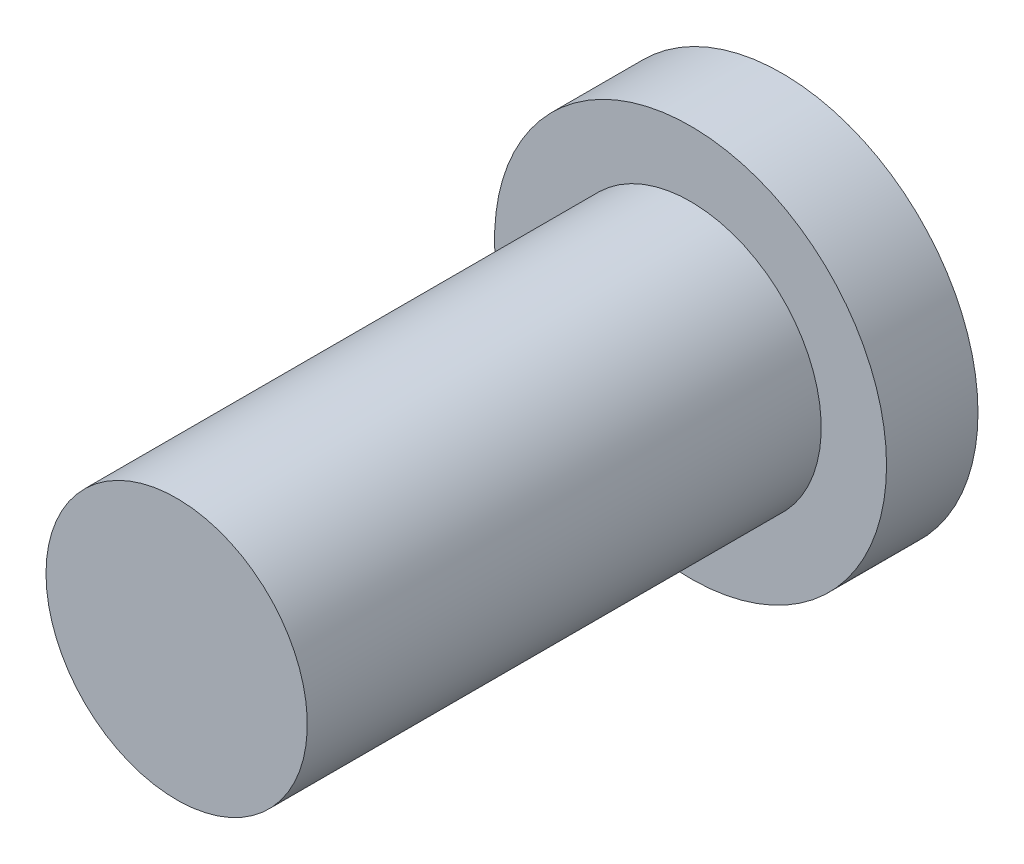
ISO-10303-21;
HEADER;
FILE_DESCRIPTION(('STEP AP214'),'2;1');
FILE_NAME('part.step','',(''),(''),'','','');
FILE_SCHEMA(('AUTOMOTIVE_DESIGN { 1 0 10303 214 1 1 1 1 }'));
ENDSEC;
DATA;
#1=APPLICATION_CONTEXT('core data for automotive mechanical design processes');
#2=APPLICATION_PROTOCOL_DEFINITION('international standard','automotive_design',2000,#1);
#3=PRODUCT_CONTEXT('',#1,'mechanical');
#4=PRODUCT('Part','Part','',(#3));
#5=PRODUCT_RELATED_PRODUCT_CATEGORY('part','',(#4));
#6=PRODUCT_DEFINITION_FORMATION('','',#4);
#7=PRODUCT_DEFINITION_CONTEXT('part definition',#1,'design');
#8=PRODUCT_DEFINITION('design','',#6,#7);
#9=PRODUCT_DEFINITION_SHAPE('','',#8);
#10=(LENGTH_UNIT() NAMED_UNIT(*) SI_UNIT(.MILLI.,.METRE.));
#11=(NAMED_UNIT(*) PLANE_ANGLE_UNIT() SI_UNIT($,.RADIAN.));
#12=(NAMED_UNIT(*) SI_UNIT($,.STERADIAN.) SOLID_ANGLE_UNIT());
#13=UNCERTAINTY_MEASURE_WITH_UNIT(LENGTH_MEASURE(1.E-05),#10,'distance_accuracy_value','');
#14=(GEOMETRIC_REPRESENTATION_CONTEXT(3) GLOBAL_UNCERTAINTY_ASSIGNED_CONTEXT((#13)) GLOBAL_UNIT_ASSIGNED_CONTEXT((#10,
#11,#12)) REPRESENTATION_CONTEXT('',''));
#15=CARTESIAN_POINT('',(0.,0.,0.));
#16=DIRECTION('',(0.,0.,1.));
#17=DIRECTION('',(1.,0.,0.));
#18=AXIS2_PLACEMENT_3D('',#15,#16,#17);
#19=CARTESIAN_POINT('',(0.,0.,0.5334));
#20=DIRECTION('',(0.,0.,1.));
#21=DIRECTION('',(1.,0.,0.));
#22=AXIS2_PLACEMENT_3D('',#19,#20,#21);
#23=PLANE('',#22);
#24=CARTESIAN_POINT('',(0.,0.,0.5334));
#25=DIRECTION('',(0.,0.,1.));
#26=DIRECTION('',(1.,0.,0.));
#27=AXIS2_PLACEMENT_3D('',#24,#25,#26);
#28=CIRCLE('',#27,1.143);
#29=CARTESIAN_POINT('',(1.143,0.,0.5334));
#30=VERTEX_POINT('',#29);
#31=EDGE_CURVE('E11',#30,#30,#28,.T.);
#32=ORIENTED_EDGE('',*,*,#31,.T.);
#33=EDGE_LOOP('',(#32));
#34=FACE_BOUND('',#33,.T.);
#35=CARTESIAN_POINT('',(0.,0.,0.5334));
#36=DIRECTION('',(0.,0.,1.));
#37=DIRECTION('',(1.,0.,0.));
#38=AXIS2_PLACEMENT_3D('',#35,#36,#37);
#39=CIRCLE('',#38,0.762);
#40=CARTESIAN_POINT('',(-0.762,0.,0.5334));
#41=VERTEX_POINT('',#40);
#42=EDGE_CURVE('E189',#41,#41,#39,.T.);
#43=ORIENTED_EDGE('',*,*,#42,.F.);
#44=EDGE_LOOP('',(#43));
#45=FACE_BOUND('',#44,.T.);
#46=ADVANCED_FACE('F33',(#34,#45),#23,.T.);
#47=CARTESIAN_POINT('',(0.,0.,0.5334));
#48=DIRECTION('',(0.,0.,-1.));
#49=DIRECTION('',(-1.,0.,0.));
#50=AXIS2_PLACEMENT_3D('',#47,#48,#49);
#51=CYLINDRICAL_SURFACE('',#50,1.143);
#52=ORIENTED_EDGE('',*,*,#31,.F.);
#53=EDGE_LOOP('',(#52));
#54=FACE_BOUND('',#53,.T.);
#55=CARTESIAN_POINT('',(0.,0.,0.));
#56=DIRECTION('',(0.,0.,1.));
#57=DIRECTION('',(1.,0.,0.));
#58=AXIS2_PLACEMENT_3D('',#55,#56,#57);
#59=CIRCLE('',#58,1.143);
#60=CARTESIAN_POINT('',(1.143,0.,0.));
#61=VERTEX_POINT('',#60);
#62=EDGE_CURVE('E37',#61,#61,#59,.T.);
#63=ORIENTED_EDGE('',*,*,#62,.T.);
#64=EDGE_LOOP('',(#63));
#65=FACE_BOUND('',#64,.T.);
#66=ADVANCED_FACE('F35',(#54,#65),#51,.T.);
#67=CARTESIAN_POINT('',(0.,0.,0.));
#68=DIRECTION('',(0.,0.,1.));
#69=DIRECTION('',(1.,0.,0.));
#70=AXIS2_PLACEMENT_3D('',#67,#68,#69);
#71=PLANE('',#70);
#72=DIRECTION('',(-1.,0.,0.));
#73=VECTOR('',#72,1.);
#74=CARTESIAN_POINT('',(0.5715,-0.1905,0.));
#75=LINE('',#74,#73);
#76=CARTESIAN_POINT('',(0.5715,-0.1905,0.));
#77=VERTEX_POINT('',#76);
#78=CARTESIAN_POINT('',(0.1905,-0.1905,0.));
#79=VERTEX_POINT('',#78);
#80=EDGE_CURVE('E158',#77,#79,#75,.T.);
#81=ORIENTED_EDGE('',*,*,#80,.F.);
#82=DIRECTION('',(0.,-1.,0.));
#83=VECTOR('',#82,1.);
#84=CARTESIAN_POINT('',(0.5715,0.1905,0.));
#85=LINE('',#84,#83);
#86=CARTESIAN_POINT('',(0.5715,0.1905,0.));
#87=VERTEX_POINT('',#86);
#88=EDGE_CURVE('E48',#87,#77,#85,.T.);
#89=ORIENTED_EDGE('',*,*,#88,.F.);
#90=DIRECTION('',(1.,0.,0.));
#91=VECTOR('',#90,1.);
#92=CARTESIAN_POINT('',(0.5715,0.1905,0.));
#93=LINE('',#92,#91);
#94=CARTESIAN_POINT('',(0.1905,0.1905,0.));
#95=VERTEX_POINT('',#94);
#96=EDGE_CURVE('E185',#95,#87,#93,.T.);
#97=ORIENTED_EDGE('',*,*,#96,.F.);
#98=DIRECTION('',(0.,-1.,0.));
#99=VECTOR('',#98,1.);
#100=CARTESIAN_POINT('',(0.1905,0.5715,0.));
#101=LINE('',#100,#99);
#102=CARTESIAN_POINT('',(0.1905,0.5715,0.));
#103=VERTEX_POINT('',#102);
#104=EDGE_CURVE('E183',#103,#95,#101,.T.);
#105=ORIENTED_EDGE('',*,*,#104,.F.);
#106=DIRECTION('',(1.,0.,0.));
#107=VECTOR('',#106,1.);
#108=CARTESIAN_POINT('',(0.1905,0.5715,0.));
#109=LINE('',#108,#107);
#110=CARTESIAN_POINT('',(-0.1905,0.5715,0.));
#111=VERTEX_POINT('',#110);
#112=EDGE_CURVE('E132',#111,#103,#109,.T.);
#113=ORIENTED_EDGE('',*,*,#112,.F.);
#114=DIRECTION('',(0.,1.,0.));
#115=VECTOR('',#114,1.);
#116=CARTESIAN_POINT('',(-0.1905,0.5715,0.));
#117=LINE('',#116,#115);
#118=CARTESIAN_POINT('',(-0.1905,0.1905,0.));
#119=VERTEX_POINT('',#118);
#120=EDGE_CURVE('E179',#119,#111,#117,.T.);
#121=ORIENTED_EDGE('',*,*,#120,.F.);
#122=DIRECTION('',(1.,0.,0.));
#123=VECTOR('',#122,1.);
#124=CARTESIAN_POINT('',(-0.1905,0.1905,0.));
#125=LINE('',#124,#123);
#126=CARTESIAN_POINT('',(-0.5715,0.1905,0.));
#127=VERTEX_POINT('',#126);
#128=EDGE_CURVE('E176',#127,#119,#125,.T.);
#129=ORIENTED_EDGE('',*,*,#128,.F.);
#130=DIRECTION('',(0.,1.,0.));
#131=VECTOR('',#130,1.);
#132=CARTESIAN_POINT('',(-0.5715,0.1905,0.));
#133=LINE('',#132,#131);
#134=CARTESIAN_POINT('',(-0.5715,-0.1905,0.));
#135=VERTEX_POINT('',#134);
#136=EDGE_CURVE('E173',#135,#127,#133,.T.);
#137=ORIENTED_EDGE('',*,*,#136,.F.);
#138=DIRECTION('',(-1.,0.,0.));
#139=VECTOR('',#138,1.);
#140=CARTESIAN_POINT('',(-0.1905,-0.1905,0.));
#141=LINE('',#140,#139);
#142=CARTESIAN_POINT('',(-0.1905,-0.1905,0.));
#143=VERTEX_POINT('',#142);
#144=EDGE_CURVE('E170',#143,#135,#141,.T.);
#145=ORIENTED_EDGE('',*,*,#144,.F.);
#146=DIRECTION('',(0.,1.,0.));
#147=VECTOR('',#146,1.);
#148=CARTESIAN_POINT('',(-0.1905,-0.1905,0.));
#149=LINE('',#148,#147);
#150=CARTESIAN_POINT('',(-0.1905,-0.5715,0.));
#151=VERTEX_POINT('',#150);
#152=EDGE_CURVE('E167',#151,#143,#149,.T.);
#153=ORIENTED_EDGE('',*,*,#152,.F.);
#154=DIRECTION('',(-1.,0.,0.));
#155=VECTOR('',#154,1.);
#156=CARTESIAN_POINT('',(0.1905,-0.5715,0.));
#157=LINE('',#156,#155);
#158=CARTESIAN_POINT('',(0.1905,-0.5715,0.));
#159=VERTEX_POINT('',#158);
#160=EDGE_CURVE('E164',#159,#151,#157,.T.);
#161=ORIENTED_EDGE('',*,*,#160,.F.);
#162=DIRECTION('',(0.,-1.,0.));
#163=VECTOR('',#162,1.);
#164=CARTESIAN_POINT('',(0.1905,-0.1905,0.));
#165=LINE('',#164,#163);
#166=EDGE_CURVE('E161',#79,#159,#165,.T.);
#167=ORIENTED_EDGE('',*,*,#166,.F.);
#168=EDGE_LOOP('',(#81,#89,#97,#105,#113,#121,#129,#137,#145,#153,#161,#167));
#169=FACE_BOUND('',#168,.T.);
#170=ORIENTED_EDGE('',*,*,#62,.F.);
#171=EDGE_LOOP('',(#170));
#172=FACE_BOUND('',#171,.T.);
#173=ADVANCED_FACE('F221',(#169,#172),#71,.F.);
#174=CARTESIAN_POINT('',(0.,0.,3.5306));
#175=DIRECTION('',(0.,0.,-1.));
#176=DIRECTION('',(-1.,0.,0.));
#177=AXIS2_PLACEMENT_3D('',#174,#175,#176);
#178=CYLINDRICAL_SURFACE('',#177,0.762);
#179=CARTESIAN_POINT('',(0.,0.,3.5306));
#180=DIRECTION('',(0.,0.,1.));
#181=DIRECTION('',(1.,0.,0.));
#182=AXIS2_PLACEMENT_3D('',#179,#180,#181);
#183=CIRCLE('',#182,0.762);
#184=CARTESIAN_POINT('',(-0.762,0.,3.5306));
#185=VERTEX_POINT('',#184);
#186=EDGE_CURVE('E207',#185,#185,#183,.T.);
#187=CARTESIAN_POINT('',(-0.762,0.,3.5306));
#188=CARTESIAN_POINT('',(-0.762,0.,3.49937916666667));
#189=CARTESIAN_POINT('',(-0.762,0.,3.46815833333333));
#190=CARTESIAN_POINT('',(-0.762,0.,3.40571666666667));
#191=CARTESIAN_POINT('',(-0.762,0.,3.37449583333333));
#192=CARTESIAN_POINT('',(-0.762,0.,3.31205416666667));
#193=CARTESIAN_POINT('',(-0.762,0.,3.28083333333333));
#194=CARTESIAN_POINT('',(-0.762,0.,3.21839166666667));
#195=CARTESIAN_POINT('',(-0.762,0.,3.18717083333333));
#196=CARTESIAN_POINT('',(-0.762,0.,3.12472916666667));
#197=CARTESIAN_POINT('',(-0.762,0.,3.09350833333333));
#198=CARTESIAN_POINT('',(-0.762,0.,3.03106666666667));
#199=CARTESIAN_POINT('',(-0.762,0.,2.99984583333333));
#200=CARTESIAN_POINT('',(-0.762,0.,2.93740416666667));
#201=CARTESIAN_POINT('',(-0.762,0.,2.90618333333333));
#202=CARTESIAN_POINT('',(-0.762,0.,2.84374166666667));
#203=CARTESIAN_POINT('',(-0.762,0.,2.81252083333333));
#204=CARTESIAN_POINT('',(-0.762,0.,2.75007916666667));
#205=CARTESIAN_POINT('',(-0.762,0.,2.71885833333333));
#206=CARTESIAN_POINT('',(-0.762,0.,2.65641666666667));
#207=CARTESIAN_POINT('',(-0.762,0.,2.62519583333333));
#208=CARTESIAN_POINT('',(-0.762,0.,2.56275416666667));
#209=CARTESIAN_POINT('',(-0.762,0.,2.53153333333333));
#210=CARTESIAN_POINT('',(-0.762,0.,2.46909166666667));
#211=CARTESIAN_POINT('',(-0.762,0.,2.43787083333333));
#212=CARTESIAN_POINT('',(-0.762,0.,2.37542916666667));
#213=CARTESIAN_POINT('',(-0.762,0.,2.34420833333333));
#214=CARTESIAN_POINT('',(-0.762,0.,2.28176666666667));
#215=CARTESIAN_POINT('',(-0.762,0.,2.25054583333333));
#216=CARTESIAN_POINT('',(-0.762,0.,2.18810416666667));
#217=CARTESIAN_POINT('',(-0.762,0.,2.15688333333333));
#218=CARTESIAN_POINT('',(-0.762,0.,2.09444166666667));
#219=CARTESIAN_POINT('',(-0.762,0.,2.06322083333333));
#220=CARTESIAN_POINT('',(-0.762,0.,2.00077916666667));
#221=CARTESIAN_POINT('',(-0.762,0.,1.96955833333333));
#222=CARTESIAN_POINT('',(-0.762,0.,1.90711666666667));
#223=CARTESIAN_POINT('',(-0.762,0.,1.87589583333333));
#224=CARTESIAN_POINT('',(-0.762,0.,1.81345416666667));
#225=CARTESIAN_POINT('',(-0.762,0.,1.78223333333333));
#226=CARTESIAN_POINT('',(-0.762,0.,1.71979166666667));
#227=CARTESIAN_POINT('',(-0.762,0.,1.68857083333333));
#228=CARTESIAN_POINT('',(-0.762,0.,1.62612916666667));
#229=CARTESIAN_POINT('',(-0.762,0.,1.59490833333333));
#230=CARTESIAN_POINT('',(-0.762,0.,1.53246666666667));
#231=CARTESIAN_POINT('',(-0.762,0.,1.50124583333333));
#232=CARTESIAN_POINT('',(-0.762,0.,1.43880416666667));
#233=CARTESIAN_POINT('',(-0.762,0.,1.40758333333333));
#234=CARTESIAN_POINT('',(-0.762,0.,1.34514166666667));
#235=CARTESIAN_POINT('',(-0.762,0.,1.31392083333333));
#236=CARTESIAN_POINT('',(-0.762,0.,1.25147916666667));
#237=CARTESIAN_POINT('',(-0.762,0.,1.22025833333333));
#238=CARTESIAN_POINT('',(-0.762,0.,1.15781666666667));
#239=CARTESIAN_POINT('',(-0.762,0.,1.12659583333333));
#240=CARTESIAN_POINT('',(-0.762,0.,1.06415416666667));
#241=CARTESIAN_POINT('',(-0.762,0.,1.03293333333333));
#242=CARTESIAN_POINT('',(-0.762,0.,0.970491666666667));
#243=CARTESIAN_POINT('',(-0.762,0.,0.939270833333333));
#244=CARTESIAN_POINT('',(-0.762,0.,0.876829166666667));
#245=CARTESIAN_POINT('',(-0.762,0.,0.845608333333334));
#246=CARTESIAN_POINT('',(-0.762,0.,0.783166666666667));
#247=CARTESIAN_POINT('',(-0.762,0.,0.751945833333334));
#248=CARTESIAN_POINT('',(-0.762,0.,0.689504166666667));
#249=CARTESIAN_POINT('',(-0.762,0.,0.658283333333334));
#250=CARTESIAN_POINT('',(-0.762,0.,0.595841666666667));
#251=CARTESIAN_POINT('',(-0.762,0.,0.564620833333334));
#252=CARTESIAN_POINT('',(-0.762,0.,0.5334));
#253=B_SPLINE_CURVE_WITH_KNOTS('',3,(#187,#188,#189,#190,#191,#192,#193,#194,#195,#196,#197,
#198,#199,#200,#201,#202,#203,#204,#205,#206,#207,#208,#209,#210,#211,#212,#213,#214,#215,#216,
#217,#218,#219,#220,#221,#222,#223,#224,#225,#226,#227,#228,#229,#230,#231,#232,#233,#234,#235,
#236,#237,#238,#239,#240,#241,#242,#243,#244,#245,#246,#247,#248,#249,#250,#251,#252),
.UNSPECIFIED.,.F.,.F.,(4,2,2,2,2,2,2,2,2,2,2,2,2,2,2,2,2,2,2,2,2,2,2,2,2,2,2,2,2,2,2,2,4),(0.,
0.0936624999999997,0.187325,0.2809875,0.37465,0.4683125,0.561975,0.6556375,0.7493,
0.842962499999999,0.936624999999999,1.0302875,1.12395,1.2176125,1.311275,1.4049375,1.4986,
1.5922625,1.685925,1.7795875,1.87325,1.9669125,2.060575,2.1542375,2.2479,2.3415625,2.435225,
2.5288875,2.62255,2.7162125,2.809875,2.9035375,2.9972),.UNSPECIFIED.);
#254=EDGE_CURVE('BSEAM213',#185,#41,#253,.T.);
#255=ORIENTED_EDGE('',*,*,#186,.F.);
#256=ORIENTED_EDGE('',*,*,#42,.T.);
#257=ORIENTED_EDGE('',*,*,#254,.T.);
#258=ORIENTED_EDGE('',*,*,#254,.F.);
#259=EDGE_LOOP('',(#255,#257,#256,#258));
#260=FACE_BOUND('',#259,.T.);
#261=ADVANCED_FACE('F213',(#260),#178,.T.);
#262=CARTESIAN_POINT('',(0.,0.,3.5306));
#263=DIRECTION('',(0.,0.,1.));
#264=DIRECTION('',(1.,0.,0.));
#265=AXIS2_PLACEMENT_3D('',#262,#263,#264);
#266=PLANE('',#265);
#267=ORIENTED_EDGE('',*,*,#186,.T.);
#268=EDGE_LOOP('',(#267));
#269=FACE_BOUND('',#268,.T.);
#270=ADVANCED_FACE('F230',(#269),#266,.T.);
#271=CARTESIAN_POINT('',(0.5715,0.1905,0.381));
#272=DIRECTION('',(1.,0.,0.));
#273=DIRECTION('',(0.,0.,-1.));
#274=AXIS2_PLACEMENT_3D('',#271,#272,#273);
#275=PLANE('',#274);
#276=ORIENTED_EDGE('',*,*,#88,.T.);
#277=DIRECTION('',(0.,0.,-1.));
#278=VECTOR('',#277,1.);
#279=CARTESIAN_POINT('',(0.5715,-0.1905,0.381));
#280=LINE('',#279,#278);
#281=CARTESIAN_POINT('',(0.5715,-0.1905,0.381));
#282=VERTEX_POINT('',#281);
#283=EDGE_CURVE('E96',#282,#77,#280,.T.);
#284=ORIENTED_EDGE('',*,*,#283,.F.);
#285=DIRECTION('',(0.,-1.,0.));
#286=VECTOR('',#285,1.);
#287=CARTESIAN_POINT('',(0.5715,0.1905,0.381));
#288=LINE('',#287,#286);
#289=CARTESIAN_POINT('',(0.5715,0.1905,0.381));
#290=VERTEX_POINT('',#289);
#291=EDGE_CURVE('E187',#290,#282,#288,.T.);
#292=ORIENTED_EDGE('',*,*,#291,.F.);
#293=DIRECTION('',(0.,0.,-1.));
#294=VECTOR('',#293,1.);
#295=CARTESIAN_POINT('',(0.5715,0.1905,0.381));
#296=LINE('',#295,#294);
#297=EDGE_CURVE('E56',#290,#87,#296,.T.);
#298=ORIENTED_EDGE('',*,*,#297,.T.);
#299=EDGE_LOOP('',(#276,#284,#292,#298));
#300=FACE_BOUND('',#299,.T.);
#301=ADVANCED_FACE('F272',(#300),#275,.F.);
#302=CARTESIAN_POINT('',(0.5715,0.1905,0.381));
#303=DIRECTION('',(0.,1.,0.));
#304=DIRECTION('',(-1.,0.,0.));
#305=AXIS2_PLACEMENT_3D('',#302,#303,#304);
#306=PLANE('',#305);
#307=ORIENTED_EDGE('',*,*,#96,.T.);
#308=ORIENTED_EDGE('',*,*,#297,.F.);
#309=DIRECTION('',(1.,0.,0.));
#310=VECTOR('',#309,1.);
#311=CARTESIAN_POINT('',(0.5715,0.1905,0.381));
#312=LINE('',#311,#310);
#313=CARTESIAN_POINT('',(0.1905,0.1905,0.381));
#314=VERTEX_POINT('',#313);
#315=EDGE_CURVE('E144',#314,#290,#312,.T.);
#316=ORIENTED_EDGE('',*,*,#315,.F.);
#317=DIRECTION('',(0.,0.,-1.));
#318=VECTOR('',#317,1.);
#319=CARTESIAN_POINT('',(0.1905,0.1905,0.381));
#320=LINE('',#319,#318);
#321=EDGE_CURVE('E136',#314,#95,#320,.T.);
#322=ORIENTED_EDGE('',*,*,#321,.T.);
#323=EDGE_LOOP('',(#307,#308,#316,#322));
#324=FACE_BOUND('',#323,.T.);
#325=ADVANCED_FACE('F270',(#324),#306,.F.);
#326=CARTESIAN_POINT('',(0.1905,0.5715,0.381));
#327=DIRECTION('',(1.,0.,0.));
#328=DIRECTION('',(0.,1.,0.));
#329=AXIS2_PLACEMENT_3D('',#326,#327,#328);
#330=PLANE('',#329);
#331=ORIENTED_EDGE('',*,*,#104,.T.);
#332=ORIENTED_EDGE('',*,*,#321,.F.);
#333=DIRECTION('',(0.,-1.,0.));
#334=VECTOR('',#333,1.);
#335=CARTESIAN_POINT('',(0.1905,0.5715,0.381));
#336=LINE('',#335,#334);
#337=CARTESIAN_POINT('',(0.1905,0.5715,0.381));
#338=VERTEX_POINT('',#337);
#339=EDGE_CURVE('E140',#338,#314,#336,.T.);
#340=ORIENTED_EDGE('',*,*,#339,.F.);
#341=DIRECTION('',(0.,0.,-1.));
#342=VECTOR('',#341,1.);
#343=CARTESIAN_POINT('',(0.1905,0.5715,0.381));
#344=LINE('',#343,#342);
#345=EDGE_CURVE('E125',#338,#103,#344,.T.);
#346=ORIENTED_EDGE('',*,*,#345,.T.);
#347=EDGE_LOOP('',(#331,#332,#340,#346));
#348=FACE_BOUND('',#347,.T.);
#349=ADVANCED_FACE('F141',(#348),#330,.F.);
#350=CARTESIAN_POINT('',(0.1905,0.5715,0.381));
#351=DIRECTION('',(0.,1.,0.));
#352=DIRECTION('',(0.,0.,1.));
#353=AXIS2_PLACEMENT_3D('',#350,#351,#352);
#354=PLANE('',#353);
#355=ORIENTED_EDGE('',*,*,#112,.T.);
#356=ORIENTED_EDGE('',*,*,#345,.F.);
#357=DIRECTION('',(1.,0.,0.));
#358=VECTOR('',#357,1.);
#359=CARTESIAN_POINT('',(0.1905,0.5715,0.381));
#360=LINE('',#359,#358);
#361=CARTESIAN_POINT('',(-0.1905,0.5715,0.381));
#362=VERTEX_POINT('',#361);
#363=EDGE_CURVE('E129',#362,#338,#360,.T.);
#364=ORIENTED_EDGE('',*,*,#363,.F.);
#365=DIRECTION('',(0.,0.,-1.));
#366=VECTOR('',#365,1.);
#367=CARTESIAN_POINT('',(-0.1905,0.5715,0.381));
#368=LINE('',#367,#366);
#369=EDGE_CURVE('E137',#362,#111,#368,.T.);
#370=ORIENTED_EDGE('',*,*,#369,.T.);
#371=EDGE_LOOP('',(#355,#356,#364,#370));
#372=FACE_BOUND('',#371,.T.);
#373=ADVANCED_FACE('F127',(#372),#354,.F.);
#374=CARTESIAN_POINT('',(-0.1905,0.5715,0.381));
#375=DIRECTION('',(-1.,0.,0.));
#376=DIRECTION('',(0.,-1.,0.));
#377=AXIS2_PLACEMENT_3D('',#374,#375,#376);
#378=PLANE('',#377);
#379=ORIENTED_EDGE('',*,*,#120,.T.);
#380=ORIENTED_EDGE('',*,*,#369,.F.);
#381=DIRECTION('',(0.,1.,0.));
#382=VECTOR('',#381,1.);
#383=CARTESIAN_POINT('',(-0.1905,0.5715,0.381));
#384=LINE('',#383,#382);
#385=CARTESIAN_POINT('',(-0.1905,0.1905,0.381));
#386=VERTEX_POINT('',#385);
#387=EDGE_CURVE('E150',#386,#362,#384,.T.);
#388=ORIENTED_EDGE('',*,*,#387,.F.);
#389=DIRECTION('',(0.,0.,-1.));
#390=VECTOR('',#389,1.);
#391=CARTESIAN_POINT('',(-0.1905,0.1905,0.381));
#392=LINE('',#391,#390);
#393=EDGE_CURVE('E192',#386,#119,#392,.T.);
#394=ORIENTED_EDGE('',*,*,#393,.T.);
#395=EDGE_LOOP('',(#379,#380,#388,#394));
#396=FACE_BOUND('',#395,.T.);
#397=ADVANCED_FACE('F269',(#396),#378,.F.);
#398=CARTESIAN_POINT('',(-0.1905,0.1905,0.381));
#399=DIRECTION('',(0.,1.,0.));
#400=DIRECTION('',(-1.,0.,0.));
#401=AXIS2_PLACEMENT_3D('',#398,#399,#400);
#402=PLANE('',#401);
#403=ORIENTED_EDGE('',*,*,#128,.T.);
#404=ORIENTED_EDGE('',*,*,#393,.F.);
#405=DIRECTION('',(1.,0.,0.));
#406=VECTOR('',#405,1.);
#407=CARTESIAN_POINT('',(-0.1905,0.1905,0.381));
#408=LINE('',#407,#406);
#409=CARTESIAN_POINT('',(-0.5715,0.1905,0.381));
#410=VERTEX_POINT('',#409);
#411=EDGE_CURVE('E152',#410,#386,#408,.T.);
#412=ORIENTED_EDGE('',*,*,#411,.F.);
#413=DIRECTION('',(0.,0.,-1.));
#414=VECTOR('',#413,1.);
#415=CARTESIAN_POINT('',(-0.5715,0.1905,0.381));
#416=LINE('',#415,#414);
#417=EDGE_CURVE('E194',#410,#127,#416,.T.);
#418=ORIENTED_EDGE('',*,*,#417,.T.);
#419=EDGE_LOOP('',(#403,#404,#412,#418));
#420=FACE_BOUND('',#419,.T.);
#421=ADVANCED_FACE('F265',(#420),#402,.F.);
#422=CARTESIAN_POINT('',(-0.5715,0.1905,0.381));
#423=DIRECTION('',(-1.,0.,0.));
#424=DIRECTION('',(0.,0.,1.));
#425=AXIS2_PLACEMENT_3D('',#422,#423,#424);
#426=PLANE('',#425);
#427=ORIENTED_EDGE('',*,*,#136,.T.);
#428=ORIENTED_EDGE('',*,*,#417,.F.);
#429=DIRECTION('',(0.,1.,0.));
#430=VECTOR('',#429,1.);
#431=CARTESIAN_POINT('',(-0.5715,0.1905,0.381));
#432=LINE('',#431,#430);
#433=CARTESIAN_POINT('',(-0.5715,-0.1905,0.381));
#434=VERTEX_POINT('',#433);
#435=EDGE_CURVE('E260',#434,#410,#432,.T.);
#436=ORIENTED_EDGE('',*,*,#435,.F.);
#437=DIRECTION('',(0.,0.,-1.));
#438=VECTOR('',#437,1.);
#439=CARTESIAN_POINT('',(-0.5715,-0.1905,0.381));
#440=LINE('',#439,#438);
#441=EDGE_CURVE('E196',#434,#135,#440,.T.);
#442=ORIENTED_EDGE('',*,*,#441,.T.);
#443=EDGE_LOOP('',(#427,#428,#436,#442));
#444=FACE_BOUND('',#443,.T.);
#445=ADVANCED_FACE('F288',(#444),#426,.F.);
#446=CARTESIAN_POINT('',(-0.1905,-0.1905,0.381));
#447=DIRECTION('',(0.,-1.,0.));
#448=DIRECTION('',(1.,0.,0.));
#449=AXIS2_PLACEMENT_3D('',#446,#447,#448);
#450=PLANE('',#449);
#451=ORIENTED_EDGE('',*,*,#144,.T.);
#452=ORIENTED_EDGE('',*,*,#441,.F.);
#453=DIRECTION('',(-1.,0.,0.));
#454=VECTOR('',#453,1.);
#455=CARTESIAN_POINT('',(-0.1905,-0.1905,0.381));
#456=LINE('',#455,#454);
#457=CARTESIAN_POINT('',(-0.1905,-0.1905,0.381));
#458=VERTEX_POINT('',#457);
#459=EDGE_CURVE('E257',#458,#434,#456,.T.);
#460=ORIENTED_EDGE('',*,*,#459,.F.);
#461=DIRECTION('',(0.,0.,-1.));
#462=VECTOR('',#461,1.);
#463=CARTESIAN_POINT('',(-0.1905,-0.1905,0.381));
#464=LINE('',#463,#462);
#465=EDGE_CURVE('E198',#458,#143,#464,.T.);
#466=ORIENTED_EDGE('',*,*,#465,.T.);
#467=EDGE_LOOP('',(#451,#452,#460,#466));
#468=FACE_BOUND('',#467,.T.);
#469=ADVANCED_FACE('F291',(#468),#450,.F.);
#470=CARTESIAN_POINT('',(-0.1905,-0.1905,0.381));
#471=DIRECTION('',(-1.,0.,0.));
#472=DIRECTION('',(0.,-1.,0.));
#473=AXIS2_PLACEMENT_3D('',#470,#471,#472);
#474=PLANE('',#473);
#475=ORIENTED_EDGE('',*,*,#152,.T.);
#476=ORIENTED_EDGE('',*,*,#465,.F.);
#477=DIRECTION('',(0.,1.,0.));
#478=VECTOR('',#477,1.);
#479=CARTESIAN_POINT('',(-0.1905,-0.1905,0.381));
#480=LINE('',#479,#478);
#481=CARTESIAN_POINT('',(-0.1905,-0.5715,0.381));
#482=VERTEX_POINT('',#481);
#483=EDGE_CURVE('E254',#482,#458,#480,.T.);
#484=ORIENTED_EDGE('',*,*,#483,.F.);
#485=DIRECTION('',(0.,0.,-1.));
#486=VECTOR('',#485,1.);
#487=CARTESIAN_POINT('',(-0.1905,-0.5715,0.381));
#488=LINE('',#487,#486);
#489=EDGE_CURVE('E200',#482,#151,#488,.T.);
#490=ORIENTED_EDGE('',*,*,#489,.T.);
#491=EDGE_LOOP('',(#475,#476,#484,#490));
#492=FACE_BOUND('',#491,.T.);
#493=ADVANCED_FACE('F295',(#492),#474,.F.);
#494=CARTESIAN_POINT('',(0.1905,-0.5715,0.381));
#495=DIRECTION('',(0.,-1.,0.));
#496=DIRECTION('',(0.,0.,-1.));
#497=AXIS2_PLACEMENT_3D('',#494,#495,#496);
#498=PLANE('',#497);
#499=ORIENTED_EDGE('',*,*,#160,.T.);
#500=ORIENTED_EDGE('',*,*,#489,.F.);
#501=DIRECTION('',(-1.,0.,0.));
#502=VECTOR('',#501,1.);
#503=CARTESIAN_POINT('',(0.1905,-0.5715,0.381));
#504=LINE('',#503,#502);
#505=CARTESIAN_POINT('',(0.1905,-0.5715,0.381));
#506=VERTEX_POINT('',#505);
#507=EDGE_CURVE('E251',#506,#482,#504,.T.);
#508=ORIENTED_EDGE('',*,*,#507,.F.);
#509=DIRECTION('',(0.,0.,-1.));
#510=VECTOR('',#509,1.);
#511=CARTESIAN_POINT('',(0.1905,-0.5715,0.381));
#512=LINE('',#511,#510);
#513=EDGE_CURVE('E202',#506,#159,#512,.T.);
#514=ORIENTED_EDGE('',*,*,#513,.T.);
#515=EDGE_LOOP('',(#499,#500,#508,#514));
#516=FACE_BOUND('',#515,.T.);
#517=ADVANCED_FACE('F299',(#516),#498,.F.);
#518=CARTESIAN_POINT('',(0.1905,-0.1905,0.381));
#519=DIRECTION('',(1.,0.,0.));
#520=DIRECTION('',(0.,1.,0.));
#521=AXIS2_PLACEMENT_3D('',#518,#519,#520);
#522=PLANE('',#521);
#523=ORIENTED_EDGE('',*,*,#166,.T.);
#524=ORIENTED_EDGE('',*,*,#513,.F.);
#525=DIRECTION('',(0.,-1.,0.));
#526=VECTOR('',#525,1.);
#527=CARTESIAN_POINT('',(0.1905,-0.1905,0.381));
#528=LINE('',#527,#526);
#529=CARTESIAN_POINT('',(0.1905,-0.1905,0.381));
#530=VERTEX_POINT('',#529);
#531=EDGE_CURVE('E246',#530,#506,#528,.T.);
#532=ORIENTED_EDGE('',*,*,#531,.F.);
#533=DIRECTION('',(0.,0.,-1.));
#534=VECTOR('',#533,1.);
#535=CARTESIAN_POINT('',(0.1905,-0.1905,0.381));
#536=LINE('',#535,#534);
#537=EDGE_CURVE('E204',#530,#79,#536,.T.);
#538=ORIENTED_EDGE('',*,*,#537,.T.);
#539=EDGE_LOOP('',(#523,#524,#532,#538));
#540=FACE_BOUND('',#539,.T.);
#541=ADVANCED_FACE('F303',(#540),#522,.F.);
#542=CARTESIAN_POINT('',(0.5715,-0.1905,0.381));
#543=DIRECTION('',(0.,-1.,0.));
#544=DIRECTION('',(1.,0.,0.));
#545=AXIS2_PLACEMENT_3D('',#542,#543,#544);
#546=PLANE('',#545);
#547=ORIENTED_EDGE('',*,*,#80,.T.);
#548=ORIENTED_EDGE('',*,*,#537,.F.);
#549=DIRECTION('',(-1.,0.,0.));
#550=VECTOR('',#549,1.);
#551=CARTESIAN_POINT('',(0.5715,-0.1905,0.381));
#552=LINE('',#551,#550);
#553=EDGE_CURVE('E244',#282,#530,#552,.T.);
#554=ORIENTED_EDGE('',*,*,#553,.F.);
#555=ORIENTED_EDGE('',*,*,#283,.T.);
#556=EDGE_LOOP('',(#547,#548,#554,#555));
#557=FACE_BOUND('',#556,.T.);
#558=ADVANCED_FACE('F241',(#557),#546,.F.);
#559=CARTESIAN_POINT('',(0.5715,-0.5715,0.381));
#560=DIRECTION('',(0.,0.,-1.));
#561=DIRECTION('',(-1.,0.,0.));
#562=AXIS2_PLACEMENT_3D('',#559,#560,#561);
#563=PLANE('',#562);
#564=ORIENTED_EDGE('',*,*,#291,.T.);
#565=ORIENTED_EDGE('',*,*,#553,.T.);
#566=ORIENTED_EDGE('',*,*,#531,.T.);
#567=ORIENTED_EDGE('',*,*,#507,.T.);
#568=ORIENTED_EDGE('',*,*,#483,.T.);
#569=ORIENTED_EDGE('',*,*,#459,.T.);
#570=ORIENTED_EDGE('',*,*,#435,.T.);
#571=ORIENTED_EDGE('',*,*,#411,.T.);
#572=ORIENTED_EDGE('',*,*,#387,.T.);
#573=ORIENTED_EDGE('',*,*,#363,.T.);
#574=ORIENTED_EDGE('',*,*,#339,.T.);
#575=ORIENTED_EDGE('',*,*,#315,.T.);
#576=EDGE_LOOP('',(#564,#565,#566,#567,#568,#569,#570,#571,#572,#573,#574,#575));
#577=FACE_BOUND('',#576,.T.);
#578=ADVANCED_FACE('F147',(#577),#563,.T.);
#579=CLOSED_SHELL('',(#46,#66,#173,#261,#270,#301,#325,#349,#373,#397,#421,#445,#469,#493,#517,
#541,#558,#578));
#580=MANIFOLD_SOLID_BREP('B2',#579);
#581=ADVANCED_BREP_SHAPE_REPRESENTATION('',(#18,#580),#14);
#582=SHAPE_DEFINITION_REPRESENTATION(#9,#581);
ENDSEC;
END-ISO-10303-21;
